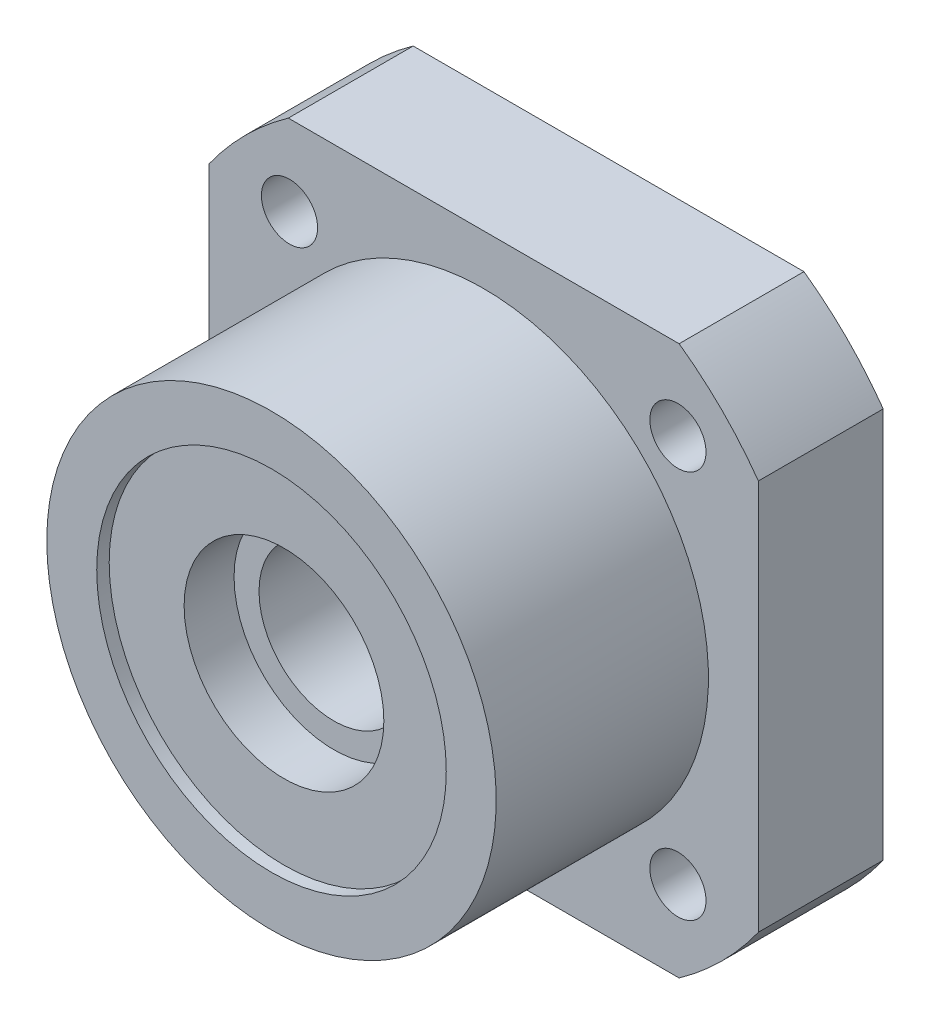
ISO-10303-21;
HEADER;
FILE_DESCRIPTION(('STEP AP214'),'2;1');
FILE_NAME('part.step','',(''),(''),'','','');
FILE_SCHEMA(('AUTOMOTIVE_DESIGN { 1 0 10303 214 1 1 1 1 }'));
ENDSEC;
DATA;
#1=APPLICATION_CONTEXT('core data for automotive mechanical design processes');
#2=APPLICATION_PROTOCOL_DEFINITION('international standard','automotive_design',2000,#1);
#3=PRODUCT_CONTEXT('',#1,'mechanical');
#4=PRODUCT('Part','Part','',(#3));
#5=PRODUCT_RELATED_PRODUCT_CATEGORY('part','',(#4));
#6=PRODUCT_DEFINITION_FORMATION('','',#4);
#7=PRODUCT_DEFINITION_CONTEXT('part definition',#1,'design');
#8=PRODUCT_DEFINITION('design','',#6,#7);
#9=PRODUCT_DEFINITION_SHAPE('','',#8);
#10=(LENGTH_UNIT() NAMED_UNIT(*) SI_UNIT(.MILLI.,.METRE.));
#11=(NAMED_UNIT(*) PLANE_ANGLE_UNIT() SI_UNIT($,.RADIAN.));
#12=(NAMED_UNIT(*) SI_UNIT($,.STERADIAN.) SOLID_ANGLE_UNIT());
#13=UNCERTAINTY_MEASURE_WITH_UNIT(LENGTH_MEASURE(1.E-05),#10,'distance_accuracy_value','');
#14=(GEOMETRIC_REPRESENTATION_CONTEXT(3) GLOBAL_UNCERTAINTY_ASSIGNED_CONTEXT((#13)) GLOBAL_UNIT_ASSIGNED_CONTEXT((#10,
#11,#12)) REPRESENTATION_CONTEXT('',''));
#15=CARTESIAN_POINT('',(0.,0.,0.));
#16=DIRECTION('',(0.,0.,1.));
#17=DIRECTION('',(1.,0.,0.));
#18=AXIS2_PLACEMENT_3D('',#15,#16,#17);
#19=CARTESIAN_POINT('',(-18.216,-18.216,27.));
#20=DIRECTION('',(0.,0.,1.));
#21=DIRECTION('',(1.,0.,0.));
#22=AXIS2_PLACEMENT_3D('',#19,#20,#21);
#23=PLANE('',#22);
#24=CARTESIAN_POINT('',(0.,0.,27.));
#25=DIRECTION('',(0.,0.,1.));
#26=DIRECTION('',(1.,0.,0.));
#27=AXIS2_PLACEMENT_3D('',#24,#25,#26);
#28=CIRCLE('',#27,14.);
#29=CARTESIAN_POINT('',(14.,0.,27.));
#30=VERTEX_POINT('',#29);
#31=EDGE_CURVE('E207',#30,#30,#28,.T.);
#32=ORIENTED_EDGE('',*,*,#31,.F.);
#33=EDGE_LOOP('',(#32));
#34=FACE_BOUND('',#33,.T.);
#35=CARTESIAN_POINT('',(0.,0.,27.));
#36=DIRECTION('',(0.,0.,-1.));
#37=DIRECTION('',(-1.,0.,0.));
#38=AXIS2_PLACEMENT_3D('',#35,#36,#37);
#39=CIRCLE('',#38,18.);
#40=CARTESIAN_POINT('',(-18.,0.,27.));
#41=VERTEX_POINT('',#40);
#42=EDGE_CURVE('E21',#41,#41,#39,.F.);
#43=ORIENTED_EDGE('',*,*,#42,.T.);
#44=EDGE_LOOP('',(#43));
#45=FACE_BOUND('',#44,.T.);
#46=ADVANCED_FACE('F17',(#34,#45),#23,.T.);
#47=CARTESIAN_POINT('',(0.,0.,27.));
#48=DIRECTION('',(0.,0.,-1.));
#49=DIRECTION('',(-1.,0.,0.));
#50=AXIS2_PLACEMENT_3D('',#47,#48,#49);
#51=CYLINDRICAL_SURFACE('',#50,18.);
#52=ORIENTED_EDGE('',*,*,#42,.F.);
#53=EDGE_LOOP('',(#52));
#54=FACE_BOUND('',#53,.T.);
#55=CARTESIAN_POINT('',(0.,0.,10.));
#56=DIRECTION('',(0.,0.,-1.));
#57=DIRECTION('',(-1.,0.,0.));
#58=AXIS2_PLACEMENT_3D('',#55,#56,#57);
#59=CIRCLE('',#58,18.);
#60=CARTESIAN_POINT('',(-18.,0.,10.));
#61=VERTEX_POINT('',#60);
#62=EDGE_CURVE('E205',#61,#61,#59,.T.);
#63=ORIENTED_EDGE('',*,*,#62,.F.);
#64=EDGE_LOOP('',(#63));
#65=FACE_BOUND('',#64,.T.);
#66=ADVANCED_FACE('F215',(#54,#65),#51,.T.);
#67=CARTESIAN_POINT('',(15.556349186,15.556349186,10.));
#68=DIRECTION('',(0.,0.,-1.));
#69=DIRECTION('',(-1.,0.,0.));
#70=AXIS2_PLACEMENT_3D('',#67,#68,#69);
#71=CYLINDRICAL_SURFACE('',#70,2.25);
#72=CARTESIAN_POINT('',(15.556349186,15.556349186,10.));
#73=DIRECTION('',(0.,0.,-1.));
#74=DIRECTION('',(-1.,0.,0.));
#75=AXIS2_PLACEMENT_3D('',#72,#73,#74);
#76=CIRCLE('',#75,2.25);
#77=CARTESIAN_POINT('',(13.306349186,15.556349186,10.));
#78=VERTEX_POINT('',#77);
#79=EDGE_CURVE('E193',#78,#78,#76,.T.);
#80=ORIENTED_EDGE('',*,*,#79,.F.);
#81=EDGE_LOOP('',(#80));
#82=FACE_BOUND('',#81,.T.);
#83=CARTESIAN_POINT('',(15.556349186,15.556349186,4.));
#84=DIRECTION('',(0.,0.,-1.));
#85=DIRECTION('',(-1.,0.,0.));
#86=AXIS2_PLACEMENT_3D('',#83,#84,#85);
#87=CIRCLE('',#86,2.25);
#88=CARTESIAN_POINT('',(13.306349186,15.556349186,4.));
#89=VERTEX_POINT('',#88);
#90=EDGE_CURVE('E190',#89,#89,#87,.F.);
#91=ORIENTED_EDGE('',*,*,#90,.F.);
#92=EDGE_LOOP('',(#91));
#93=FACE_BOUND('',#92,.T.);
#94=ADVANCED_FACE('F218',(#82,#93),#71,.F.);
#95=CARTESIAN_POINT('',(-15.556349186,15.556349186,10.));
#96=DIRECTION('',(0.,0.,-1.));
#97=DIRECTION('',(-1.,0.,0.));
#98=AXIS2_PLACEMENT_3D('',#95,#96,#97);
#99=CYLINDRICAL_SURFACE('',#98,2.25);
#100=CARTESIAN_POINT('',(-15.556349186,15.556349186,10.));
#101=DIRECTION('',(0.,0.,-1.));
#102=DIRECTION('',(-1.,0.,0.));
#103=AXIS2_PLACEMENT_3D('',#100,#101,#102);
#104=CIRCLE('',#103,2.25);
#105=CARTESIAN_POINT('',(-17.806349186,15.556349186,10.));
#106=VERTEX_POINT('',#105);
#107=EDGE_CURVE('E202',#106,#106,#104,.T.);
#108=ORIENTED_EDGE('',*,*,#107,.F.);
#109=EDGE_LOOP('',(#108));
#110=FACE_BOUND('',#109,.T.);
#111=CARTESIAN_POINT('',(-15.556349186,15.556349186,4.));
#112=DIRECTION('',(0.,0.,-1.));
#113=DIRECTION('',(-1.,0.,0.));
#114=AXIS2_PLACEMENT_3D('',#111,#112,#113);
#115=CIRCLE('',#114,2.25);
#116=CARTESIAN_POINT('',(-17.806349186,15.556349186,4.));
#117=VERTEX_POINT('',#116);
#118=EDGE_CURVE('E187',#117,#117,#115,.F.);
#119=ORIENTED_EDGE('',*,*,#118,.F.);
#120=EDGE_LOOP('',(#119));
#121=FACE_BOUND('',#120,.T.);
#122=ADVANCED_FACE('F304',(#110,#121),#99,.F.);
#123=CARTESIAN_POINT('',(-15.556349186,-15.556349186,10.));
#124=DIRECTION('',(0.,0.,-1.));
#125=DIRECTION('',(-1.,0.,0.));
#126=AXIS2_PLACEMENT_3D('',#123,#124,#125);
#127=CYLINDRICAL_SURFACE('',#126,2.25);
#128=CARTESIAN_POINT('',(-15.556349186,-15.556349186,10.));
#129=DIRECTION('',(0.,0.,-1.));
#130=DIRECTION('',(-1.,0.,0.));
#131=AXIS2_PLACEMENT_3D('',#128,#129,#130);
#132=CIRCLE('',#131,2.25);
#133=CARTESIAN_POINT('',(-17.806349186,-15.556349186,10.));
#134=VERTEX_POINT('',#133);
#135=EDGE_CURVE('E199',#134,#134,#132,.T.);
#136=ORIENTED_EDGE('',*,*,#135,.F.);
#137=EDGE_LOOP('',(#136));
#138=FACE_BOUND('',#137,.T.);
#139=CARTESIAN_POINT('',(-15.556349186,-15.556349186,4.));
#140=DIRECTION('',(0.,0.,-1.));
#141=DIRECTION('',(-1.,0.,0.));
#142=AXIS2_PLACEMENT_3D('',#139,#140,#141);
#143=CIRCLE('',#142,2.25);
#144=CARTESIAN_POINT('',(-17.806349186,-15.556349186,4.));
#145=VERTEX_POINT('',#144);
#146=EDGE_CURVE('E184',#145,#145,#143,.F.);
#147=ORIENTED_EDGE('',*,*,#146,.F.);
#148=EDGE_LOOP('',(#147));
#149=FACE_BOUND('',#148,.T.);
#150=ADVANCED_FACE('F300',(#138,#149),#127,.F.);
#151=CARTESIAN_POINT('',(15.556349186,-15.556349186,10.));
#152=DIRECTION('',(0.,0.,-1.));
#153=DIRECTION('',(-1.,0.,0.));
#154=AXIS2_PLACEMENT_3D('',#151,#152,#153);
#155=CYLINDRICAL_SURFACE('',#154,2.25);
#156=CARTESIAN_POINT('',(15.556349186,-15.556349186,10.));
#157=DIRECTION('',(0.,0.,-1.));
#158=DIRECTION('',(-1.,0.,0.));
#159=AXIS2_PLACEMENT_3D('',#156,#157,#158);
#160=CIRCLE('',#159,2.25);
#161=CARTESIAN_POINT('',(13.306349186,-15.556349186,10.));
#162=VERTEX_POINT('',#161);
#163=EDGE_CURVE('E196',#162,#162,#160,.T.);
#164=ORIENTED_EDGE('',*,*,#163,.F.);
#165=EDGE_LOOP('',(#164));
#166=FACE_BOUND('',#165,.T.);
#167=CARTESIAN_POINT('',(15.556349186,-15.556349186,4.));
#168=DIRECTION('',(0.,0.,-1.));
#169=DIRECTION('',(-1.,0.,0.));
#170=AXIS2_PLACEMENT_3D('',#167,#168,#169);
#171=CIRCLE('',#170,2.25);
#172=CARTESIAN_POINT('',(13.306349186,-15.556349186,4.));
#173=VERTEX_POINT('',#172);
#174=EDGE_CURVE('E181',#173,#173,#171,.F.);
#175=ORIENTED_EDGE('',*,*,#174,.F.);
#176=EDGE_LOOP('',(#175));
#177=FACE_BOUND('',#176,.T.);
#178=ADVANCED_FACE('F235',(#166,#177),#155,.F.);
#179=CARTESIAN_POINT('',(0.,0.,26.));
#180=DIRECTION('',(0.,0.,1.));
#181=DIRECTION('',(1.,0.,0.));
#182=AXIS2_PLACEMENT_3D('',#179,#180,#181);
#183=CYLINDRICAL_SURFACE('',#182,14.);
#184=ORIENTED_EDGE('',*,*,#31,.T.);
#185=EDGE_LOOP('',(#184));
#186=FACE_BOUND('',#185,.T.);
#187=CARTESIAN_POINT('',(0.,0.,26.));
#188=DIRECTION('',(0.,0.,1.));
#189=DIRECTION('',(1.,0.,0.));
#190=AXIS2_PLACEMENT_3D('',#187,#188,#189);
#191=CIRCLE('',#190,14.);
#192=CARTESIAN_POINT('',(14.,0.,26.));
#193=VERTEX_POINT('',#192);
#194=EDGE_CURVE('E91',#193,#193,#191,.T.);
#195=ORIENTED_EDGE('',*,*,#194,.F.);
#196=EDGE_LOOP('',(#195));
#197=FACE_BOUND('',#196,.T.);
#198=ADVANCED_FACE('F224',(#186,#197),#183,.F.);
#199=CARTESIAN_POINT('',(-21.999999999,-22.,10.));
#200=DIRECTION('',(0.,0.,1.));
#201=DIRECTION('',(1.,0.,0.));
#202=AXIS2_PLACEMENT_3D('',#199,#200,#201);
#203=PLANE('',#202);
#204=ORIENTED_EDGE('',*,*,#79,.T.);
#205=EDGE_LOOP('',(#204));
#206=FACE_BOUND('',#205,.T.);
#207=ORIENTED_EDGE('',*,*,#163,.T.);
#208=EDGE_LOOP('',(#207));
#209=FACE_BOUND('',#208,.T.);
#210=ORIENTED_EDGE('',*,*,#135,.T.);
#211=EDGE_LOOP('',(#210));
#212=FACE_BOUND('',#211,.T.);
#213=ORIENTED_EDGE('',*,*,#107,.T.);
#214=EDGE_LOOP('',(#213));
#215=FACE_BOUND('',#214,.T.);
#216=ORIENTED_EDGE('',*,*,#62,.T.);
#217=EDGE_LOOP('',(#216));
#218=FACE_BOUND('',#217,.T.);
#219=CARTESIAN_POINT('',(0.,0.,10.));
#220=DIRECTION('',(0.,0.,-1.));
#221=DIRECTION('',(-1.,0.,0.));
#222=AXIS2_PLACEMENT_3D('',#219,#220,#221);
#223=CIRCLE('',#222,27.);
#224=CARTESIAN_POINT('',(15.6524758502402,-21.999999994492,10.));
#225=VERTEX_POINT('',#224);
#226=CARTESIAN_POINT('',(22.,-15.6524758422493,10.));
#227=VERTEX_POINT('',#226);
#228=EDGE_CURVE('E175',#225,#227,#223,.F.);
#229=ORIENTED_EDGE('',*,*,#228,.T.);
#230=DIRECTION('',(0.,1.,0.));
#231=VECTOR('',#230,1.);
#232=CARTESIAN_POINT('',(22.,-1.49999804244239E-09,10.));
#233=LINE('',#232,#231);
#234=CARTESIAN_POINT('',(22.000000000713,15.6524758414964,10.));
#235=VERTEX_POINT('',#234);
#236=EDGE_CURVE('E106',#227,#235,#233,.T.);
#237=ORIENTED_EDGE('',*,*,#236,.T.);
#238=CARTESIAN_POINT('',(0.,0.,10.));
#239=DIRECTION('',(0.,0.,-1.));
#240=DIRECTION('',(-1.,0.,0.));
#241=AXIS2_PLACEMENT_3D('',#238,#239,#240);
#242=CIRCLE('',#241,27.);
#243=CARTESIAN_POINT('',(15.6524758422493,22.,10.));
#244=VERTEX_POINT('',#243);
#245=EDGE_CURVE('E100',#235,#244,#242,.F.);
#246=ORIENTED_EDGE('',*,*,#245,.T.);
#247=DIRECTION('',(-1.,0.,0.));
#248=VECTOR('',#247,1.);
#249=CARTESIAN_POINT('',(4.99999347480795E-10,22.,10.));
#250=LINE('',#249,#248);
#251=CARTESIAN_POINT('',(-15.6524758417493,22.,10.));
#252=VERTEX_POINT('',#251);
#253=EDGE_CURVE('E94',#244,#252,#250,.T.);
#254=ORIENTED_EDGE('',*,*,#253,.T.);
#255=CARTESIAN_POINT('',(0.,0.,10.));
#256=DIRECTION('',(0.,0.,-1.));
#257=DIRECTION('',(-1.,0.,0.));
#258=AXIS2_PLACEMENT_3D('',#255,#256,#257);
#259=CIRCLE('',#258,27.);
#260=CARTESIAN_POINT('',(-22.,15.6524758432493,10.));
#261=VERTEX_POINT('',#260);
#262=EDGE_CURVE('E82',#252,#261,#259,.F.);
#263=ORIENTED_EDGE('',*,*,#262,.T.);
#264=DIRECTION('',(0.,-1.,0.));
#265=VECTOR('',#264,1.);
#266=CARTESIAN_POINT('',(-22.,-1.00000042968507E-09,10.));
#267=LINE('',#266,#265);
#268=CARTESIAN_POINT('',(-21.9999999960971,-15.6524758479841,10.));
#269=VERTEX_POINT('',#268);
#270=EDGE_CURVE('E114',#261,#269,#267,.T.);
#271=ORIENTED_EDGE('',*,*,#270,.T.);
#272=CARTESIAN_POINT('',(0.,0.,10.));
#273=DIRECTION('',(0.,0.,-1.));
#274=DIRECTION('',(-1.,0.,0.));
#275=AXIS2_PLACEMENT_3D('',#272,#273,#274);
#276=CIRCLE('',#275,27.);
#277=CARTESIAN_POINT('',(-15.6524758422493,-22.,10.));
#278=VERTEX_POINT('',#277);
#279=EDGE_CURVE('E177',#269,#278,#276,.F.);
#280=ORIENTED_EDGE('',*,*,#279,.T.);
#281=DIRECTION('',(1.,0.,0.));
#282=VECTOR('',#281,1.);
#283=CARTESIAN_POINT('',(3.0000012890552E-09,-22.,10.));
#284=LINE('',#283,#282);
#285=EDGE_CURVE('E110',#278,#225,#284,.T.);
#286=ORIENTED_EDGE('',*,*,#285,.T.);
#287=EDGE_LOOP('',(#229,#237,#246,#254,#263,#271,#280,#286));
#288=FACE_BOUND('',#287,.T.);
#289=ADVANCED_FACE('F98',(#206,#209,#212,#215,#218,#288),#203,.T.);
#290=CARTESIAN_POINT('',(19.604349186,11.508349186,4.));
#291=DIRECTION('',(0.,0.,-1.));
#292=DIRECTION('',(-1.,0.,0.));
#293=AXIS2_PLACEMENT_3D('',#290,#291,#292);
#294=PLANE('',#293);
#295=ORIENTED_EDGE('',*,*,#90,.T.);
#296=EDGE_LOOP('',(#295));
#297=FACE_BOUND('',#296,.T.);
#298=CARTESIAN_POINT('',(15.556349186,15.556349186,4.));
#299=DIRECTION('',(0.,0.,-1.));
#300=DIRECTION('',(-1.,0.,0.));
#301=AXIS2_PLACEMENT_3D('',#298,#299,#300);
#302=CIRCLE('',#301,4.);
#303=CARTESIAN_POINT('',(11.556349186,15.556349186,4.));
#304=VERTEX_POINT('',#303);
#305=EDGE_CURVE('E96',#304,#304,#302,.F.);
#306=ORIENTED_EDGE('',*,*,#305,.F.);
#307=EDGE_LOOP('',(#306));
#308=FACE_BOUND('',#307,.T.);
#309=ADVANCED_FACE('F223',(#297,#308),#294,.T.);
#310=CARTESIAN_POINT('',(-11.508349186,11.508349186,4.));
#311=DIRECTION('',(0.,0.,-1.));
#312=DIRECTION('',(-1.,0.,0.));
#313=AXIS2_PLACEMENT_3D('',#310,#311,#312);
#314=PLANE('',#313);
#315=ORIENTED_EDGE('',*,*,#118,.T.);
#316=EDGE_LOOP('',(#315));
#317=FACE_BOUND('',#316,.T.);
#318=CARTESIAN_POINT('',(-15.556349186,15.556349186,4.));
#319=DIRECTION('',(0.,0.,-1.));
#320=DIRECTION('',(-1.,0.,0.));
#321=AXIS2_PLACEMENT_3D('',#318,#319,#320);
#322=CIRCLE('',#321,4.);
#323=CARTESIAN_POINT('',(-19.556349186,15.556349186,4.));
#324=VERTEX_POINT('',#323);
#325=EDGE_CURVE('E169',#324,#324,#322,.F.);
#326=ORIENTED_EDGE('',*,*,#325,.F.);
#327=EDGE_LOOP('',(#326));
#328=FACE_BOUND('',#327,.T.);
#329=ADVANCED_FACE('F232',(#317,#328),#314,.T.);
#330=CARTESIAN_POINT('',(-11.508349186,-19.604349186,4.));
#331=DIRECTION('',(0.,0.,-1.));
#332=DIRECTION('',(-1.,0.,0.));
#333=AXIS2_PLACEMENT_3D('',#330,#331,#332);
#334=PLANE('',#333);
#335=ORIENTED_EDGE('',*,*,#146,.T.);
#336=EDGE_LOOP('',(#335));
#337=FACE_BOUND('',#336,.T.);
#338=CARTESIAN_POINT('',(-15.556349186,-15.556349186,4.));
#339=DIRECTION('',(0.,0.,-1.));
#340=DIRECTION('',(-1.,0.,0.));
#341=AXIS2_PLACEMENT_3D('',#338,#339,#340);
#342=CIRCLE('',#341,4.);
#343=CARTESIAN_POINT('',(-19.556349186,-15.556349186,4.));
#344=VERTEX_POINT('',#343);
#345=EDGE_CURVE('E166',#344,#344,#342,.F.);
#346=ORIENTED_EDGE('',*,*,#345,.F.);
#347=EDGE_LOOP('',(#346));
#348=FACE_BOUND('',#347,.T.);
#349=ADVANCED_FACE('F363',(#337,#348),#334,.T.);
#350=CARTESIAN_POINT('',(19.604349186,-19.604349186,4.));
#351=DIRECTION('',(0.,0.,-1.));
#352=DIRECTION('',(-1.,0.,0.));
#353=AXIS2_PLACEMENT_3D('',#350,#351,#352);
#354=PLANE('',#353);
#355=ORIENTED_EDGE('',*,*,#174,.T.);
#356=EDGE_LOOP('',(#355));
#357=FACE_BOUND('',#356,.T.);
#358=CARTESIAN_POINT('',(15.556349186,-15.556349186,4.));
#359=DIRECTION('',(0.,0.,-1.));
#360=DIRECTION('',(-1.,0.,0.));
#361=AXIS2_PLACEMENT_3D('',#358,#359,#360);
#362=CIRCLE('',#361,4.);
#363=CARTESIAN_POINT('',(11.556349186,-15.556349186,4.));
#364=VERTEX_POINT('',#363);
#365=EDGE_CURVE('E163',#364,#364,#362,.F.);
#366=ORIENTED_EDGE('',*,*,#365,.F.);
#367=EDGE_LOOP('',(#366));
#368=FACE_BOUND('',#367,.T.);
#369=ADVANCED_FACE('F373',(#357,#368),#354,.T.);
#370=CARTESIAN_POINT('',(-14.168,-14.168,26.));
#371=DIRECTION('',(0.,0.,1.));
#372=DIRECTION('',(1.,0.,0.));
#373=AXIS2_PLACEMENT_3D('',#370,#371,#372);
#374=PLANE('',#373);
#375=CARTESIAN_POINT('',(0.,0.,26.));
#376=DIRECTION('',(0.,0.,-1.));
#377=DIRECTION('',(-1.,0.,0.));
#378=AXIS2_PLACEMENT_3D('',#375,#376,#377);
#379=CIRCLE('',#378,8.);
#380=CARTESIAN_POINT('',(-8.,0.,26.));
#381=VERTEX_POINT('',#380);
#382=EDGE_CURVE('E160',#381,#381,#379,.F.);
#383=ORIENTED_EDGE('',*,*,#382,.F.);
#384=EDGE_LOOP('',(#383));
#385=FACE_BOUND('',#384,.T.);
#386=ORIENTED_EDGE('',*,*,#194,.T.);
#387=EDGE_LOOP('',(#386));
#388=FACE_BOUND('',#387,.T.);
#389=ADVANCED_FACE('F296',(#385,#388),#374,.T.);
#390=CARTESIAN_POINT('',(0.,0.,10.));
#391=DIRECTION('',(0.,0.,-1.));
#392=DIRECTION('',(-1.,0.,0.));
#393=AXIS2_PLACEMENT_3D('',#390,#391,#392);
#394=CYLINDRICAL_SURFACE('',#393,27.);
#395=ORIENTED_EDGE('',*,*,#262,.F.);
#396=DIRECTION('',(0.,0.,-1.));
#397=VECTOR('',#396,1.);
#398=CARTESIAN_POINT('',(-15.652475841,22.,5.));
#399=LINE('',#398,#397);
#400=CARTESIAN_POINT('',(-15.6524758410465,22.0000000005,0.));
#401=VERTEX_POINT('',#400);
#402=EDGE_CURVE('E86',#252,#401,#399,.T.);
#403=ORIENTED_EDGE('',*,*,#402,.T.);
#404=CARTESIAN_POINT('',(0.,0.,0.));
#405=DIRECTION('',(0.,0.,-1.));
#406=DIRECTION('',(-1.,0.,0.));
#407=AXIS2_PLACEMENT_3D('',#404,#405,#406);
#408=CIRCLE('',#407,27.);
#409=CARTESIAN_POINT('',(-21.9999999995,15.652475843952,0.));
#410=VERTEX_POINT('',#409);
#411=EDGE_CURVE('E158',#401,#410,#408,.F.);
#412=ORIENTED_EDGE('',*,*,#411,.T.);
#413=DIRECTION('',(0.,0.,1.));
#414=VECTOR('',#413,1.);
#415=CARTESIAN_POINT('',(-22.,15.652475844,5.));
#416=LINE('',#415,#414);
#417=EDGE_CURVE('E87',#410,#261,#416,.T.);
#418=ORIENTED_EDGE('',*,*,#417,.T.);
#419=EDGE_LOOP('',(#395,#403,#412,#418));
#420=FACE_BOUND('',#419,.T.);
#421=ADVANCED_FACE('F84',(#420),#394,.T.);
#422=CARTESIAN_POINT('',(-22.,-15.652475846,10.));
#423=DIRECTION('',(1.,0.,0.));
#424=DIRECTION('',(0.,0.,-1.));
#425=AXIS2_PLACEMENT_3D('',#422,#423,#424);
#426=PLANE('',#425);
#427=ORIENTED_EDGE('',*,*,#270,.F.);
#428=ORIENTED_EDGE('',*,*,#417,.F.);
#429=DIRECTION('',(0.,-1.,0.));
#430=VECTOR('',#429,1.);
#431=CARTESIAN_POINT('',(-21.999999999,5.00001082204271E-10,0.));
#432=LINE('',#431,#430);
#433=CARTESIAN_POINT('',(-21.9999999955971,-15.6524758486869,0.));
#434=VERTEX_POINT('',#433);
#435=EDGE_CURVE('E157',#410,#434,#432,.T.);
#436=ORIENTED_EDGE('',*,*,#435,.T.);
#437=DIRECTION('',(0.,0.,-1.));
#438=VECTOR('',#437,1.);
#439=CARTESIAN_POINT('',(-21.9999999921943,-15.6524758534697,5.));
#440=LINE('',#439,#438);
#441=EDGE_CURVE('E115',#434,#269,#440,.F.);
#442=ORIENTED_EDGE('',*,*,#441,.T.);
#443=EDGE_LOOP('',(#427,#428,#436,#442));
#444=FACE_BOUND('',#443,.T.);
#445=ADVANCED_FACE('F293',(#444),#426,.F.);
#446=CARTESIAN_POINT('',(0.,0.,10.));
#447=DIRECTION('',(0.,0.,-1.));
#448=DIRECTION('',(-1.,0.,0.));
#449=AXIS2_PLACEMENT_3D('',#446,#447,#448);
#450=CYLINDRICAL_SURFACE('',#449,27.);
#451=ORIENTED_EDGE('',*,*,#279,.F.);
#452=ORIENTED_EDGE('',*,*,#441,.F.);
#453=CARTESIAN_POINT('',(0.,0.,0.));
#454=DIRECTION('',(0.,0.,-1.));
#455=DIRECTION('',(-1.,0.,0.));
#456=AXIS2_PLACEMENT_3D('',#453,#454,#455);
#457=CIRCLE('',#456,27.);
#458=CARTESIAN_POINT('',(-15.6524758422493,-22.,0.));
#459=VERTEX_POINT('',#458);
#460=EDGE_CURVE('E154',#434,#459,#457,.F.);
#461=ORIENTED_EDGE('',*,*,#460,.T.);
#462=DIRECTION('',(0.,0.,1.));
#463=VECTOR('',#462,1.);
#464=CARTESIAN_POINT('',(-15.652475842,-22.,5.));
#465=LINE('',#464,#463);
#466=EDGE_CURVE('E113',#459,#278,#465,.T.);
#467=ORIENTED_EDGE('',*,*,#466,.T.);
#468=EDGE_LOOP('',(#451,#452,#461,#467));
#469=FACE_BOUND('',#468,.T.);
#470=ADVANCED_FACE('F290',(#469),#450,.T.);
#471=CARTESIAN_POINT('',(15.652475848,-22.,0.));
#472=DIRECTION('',(0.,1.,0.));
#473=DIRECTION('',(-1.,0.,0.));
#474=AXIS2_PLACEMENT_3D('',#471,#472,#473);
#475=PLANE('',#474);
#476=ORIENTED_EDGE('',*,*,#285,.F.);
#477=ORIENTED_EDGE('',*,*,#466,.F.);
#478=DIRECTION('',(1.,0.,0.));
#479=VECTOR('',#478,1.);
#480=CARTESIAN_POINT('',(1.49999977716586E-09,-22.,0.));
#481=LINE('',#480,#479);
#482=CARTESIAN_POINT('',(15.6524758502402,-21.999999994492,0.));
#483=VERTEX_POINT('',#482);
#484=EDGE_CURVE('E153',#459,#483,#481,.T.);
#485=ORIENTED_EDGE('',*,*,#484,.T.);
#486=DIRECTION('',(0.,0.,-1.));
#487=VECTOR('',#486,1.);
#488=CARTESIAN_POINT('',(15.6524758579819,-21.9999999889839,5.));
#489=LINE('',#488,#487);
#490=EDGE_CURVE('E112',#483,#225,#489,.F.);
#491=ORIENTED_EDGE('',*,*,#490,.T.);
#492=EDGE_LOOP('',(#476,#477,#485,#491));
#493=FACE_BOUND('',#492,.T.);
#494=ADVANCED_FACE('F288',(#493),#475,.F.);
#495=CARTESIAN_POINT('',(0.,0.,10.));
#496=DIRECTION('',(0.,0.,-1.));
#497=DIRECTION('',(-1.,0.,0.));
#498=AXIS2_PLACEMENT_3D('',#495,#496,#497);
#499=CYLINDRICAL_SURFACE('',#498,27.);
#500=ORIENTED_EDGE('',*,*,#228,.F.);
#501=ORIENTED_EDGE('',*,*,#490,.F.);
#502=CARTESIAN_POINT('',(0.,0.,0.));
#503=DIRECTION('',(0.,0.,-1.));
#504=DIRECTION('',(-1.,0.,0.));
#505=AXIS2_PLACEMENT_3D('',#502,#503,#504);
#506=CIRCLE('',#505,27.);
#507=CARTESIAN_POINT('',(22.000000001,-15.6524758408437,0.));
#508=VERTEX_POINT('',#507);
#509=EDGE_CURVE('E150',#483,#508,#506,.F.);
#510=ORIENTED_EDGE('',*,*,#509,.T.);
#511=DIRECTION('',(0.,0.,1.));
#512=VECTOR('',#511,1.);
#513=CARTESIAN_POINT('',(22.,-15.652475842,5.));
#514=LINE('',#513,#512);
#515=EDGE_CURVE('E109',#508,#227,#514,.T.);
#516=ORIENTED_EDGE('',*,*,#515,.T.);
#517=EDGE_LOOP('',(#500,#501,#510,#516));
#518=FACE_BOUND('',#517,.T.);
#519=ADVANCED_FACE('F285',(#518),#499,.T.);
#520=CARTESIAN_POINT('',(22.,15.652475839,0.));
#521=DIRECTION('',(-1.,0.,0.));
#522=DIRECTION('',(0.,-1.,0.));
#523=AXIS2_PLACEMENT_3D('',#520,#521,#522);
#524=PLANE('',#523);
#525=ORIENTED_EDGE('',*,*,#236,.F.);
#526=ORIENTED_EDGE('',*,*,#515,.F.);
#527=DIRECTION('',(0.,1.,0.));
#528=VECTOR('',#527,1.);
#529=CARTESIAN_POINT('',(22.000000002,5.00001082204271E-10,0.));
#530=LINE('',#529,#528);
#531=CARTESIAN_POINT('',(22.000000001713,15.6524758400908,0.));
#532=VERTEX_POINT('',#531);
#533=EDGE_CURVE('E149',#508,#532,#530,.T.);
#534=ORIENTED_EDGE('',*,*,#533,.T.);
#535=DIRECTION('',(0.,0.,-1.));
#536=VECTOR('',#535,1.);
#537=CARTESIAN_POINT('',(22.000000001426,15.6524758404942,5.));
#538=LINE('',#537,#536);
#539=EDGE_CURVE('E108',#532,#235,#538,.F.);
#540=ORIENTED_EDGE('',*,*,#539,.T.);
#541=EDGE_LOOP('',(#525,#526,#534,#540));
#542=FACE_BOUND('',#541,.T.);
#543=ADVANCED_FACE('F283',(#542),#524,.F.);
#544=CARTESIAN_POINT('',(0.,0.,10.));
#545=DIRECTION('',(0.,0.,-1.));
#546=DIRECTION('',(-1.,0.,0.));
#547=AXIS2_PLACEMENT_3D('',#544,#545,#546);
#548=CYLINDRICAL_SURFACE('',#547,27.);
#549=ORIENTED_EDGE('',*,*,#245,.F.);
#550=ORIENTED_EDGE('',*,*,#539,.F.);
#551=CARTESIAN_POINT('',(0.,0.,0.));
#552=DIRECTION('',(0.,0.,-1.));
#553=DIRECTION('',(-1.,0.,0.));
#554=AXIS2_PLACEMENT_3D('',#551,#552,#553);
#555=CIRCLE('',#554,27.);
#556=CARTESIAN_POINT('',(15.6524758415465,22.0000000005,0.));
#557=VERTEX_POINT('',#556);
#558=EDGE_CURVE('E146',#532,#557,#555,.F.);
#559=ORIENTED_EDGE('',*,*,#558,.T.);
#560=DIRECTION('',(0.,0.,1.));
#561=VECTOR('',#560,1.);
#562=CARTESIAN_POINT('',(15.652475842,22.,5.));
#563=LINE('',#562,#561);
#564=EDGE_CURVE('E36',#557,#244,#563,.T.);
#565=ORIENTED_EDGE('',*,*,#564,.T.);
#566=EDGE_LOOP('',(#549,#550,#559,#565));
#567=FACE_BOUND('',#566,.T.);
#568=ADVANCED_FACE('F280',(#567),#548,.T.);
#569=CARTESIAN_POINT('',(-15.652475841,22.,0.));
#570=DIRECTION('',(0.,-1.,0.));
#571=DIRECTION('',(1.,0.,0.));
#572=AXIS2_PLACEMENT_3D('',#569,#570,#571);
#573=PLANE('',#572);
#574=ORIENTED_EDGE('',*,*,#253,.F.);
#575=ORIENTED_EDGE('',*,*,#564,.F.);
#576=DIRECTION('',(-1.,0.,0.));
#577=VECTOR('',#576,1.);
#578=CARTESIAN_POINT('',(1.49999977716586E-09,22.000000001,0.));
#579=LINE('',#578,#577);
#580=EDGE_CURVE('E95',#557,#401,#579,.T.);
#581=ORIENTED_EDGE('',*,*,#580,.T.);
#582=ORIENTED_EDGE('',*,*,#402,.F.);
#583=EDGE_LOOP('',(#574,#575,#581,#582));
#584=FACE_BOUND('',#583,.T.);
#585=ADVANCED_FACE('F93',(#584),#573,.F.);
#586=CARTESIAN_POINT('',(15.556349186,15.556349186,4.));
#587=DIRECTION('',(0.,0.,-1.));
#588=DIRECTION('',(-1.,0.,0.));
#589=AXIS2_PLACEMENT_3D('',#586,#587,#588);
#590=CYLINDRICAL_SURFACE('',#589,4.);
#591=ORIENTED_EDGE('',*,*,#305,.T.);
#592=EDGE_LOOP('',(#591));
#593=FACE_BOUND('',#592,.T.);
#594=CARTESIAN_POINT('',(15.556349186,15.556349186,0.));
#595=DIRECTION('',(0.,0.,-1.));
#596=DIRECTION('',(-1.,0.,0.));
#597=AXIS2_PLACEMENT_3D('',#594,#595,#596);
#598=CIRCLE('',#597,4.);
#599=CARTESIAN_POINT('',(11.556349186,15.556349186,0.));
#600=VERTEX_POINT('',#599);
#601=EDGE_CURVE('E143',#600,#600,#598,.T.);
#602=ORIENTED_EDGE('',*,*,#601,.T.);
#603=EDGE_LOOP('',(#602));
#604=FACE_BOUND('',#603,.T.);
#605=ADVANCED_FACE('F275',(#593,#604),#590,.F.);
#606=CARTESIAN_POINT('',(-15.556349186,15.556349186,4.));
#607=DIRECTION('',(0.,0.,-1.));
#608=DIRECTION('',(-1.,0.,0.));
#609=AXIS2_PLACEMENT_3D('',#606,#607,#608);
#610=CYLINDRICAL_SURFACE('',#609,4.);
#611=ORIENTED_EDGE('',*,*,#325,.T.);
#612=EDGE_LOOP('',(#611));
#613=FACE_BOUND('',#612,.T.);
#614=CARTESIAN_POINT('',(-15.556349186,15.556349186,0.));
#615=DIRECTION('',(0.,0.,-1.));
#616=DIRECTION('',(-1.,0.,0.));
#617=AXIS2_PLACEMENT_3D('',#614,#615,#616);
#618=CIRCLE('',#617,4.);
#619=CARTESIAN_POINT('',(-19.556349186,15.556349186,0.));
#620=VERTEX_POINT('',#619);
#621=EDGE_CURVE('E140',#620,#620,#618,.T.);
#622=ORIENTED_EDGE('',*,*,#621,.T.);
#623=EDGE_LOOP('',(#622));
#624=FACE_BOUND('',#623,.T.);
#625=ADVANCED_FACE('F271',(#613,#624),#610,.F.);
#626=CARTESIAN_POINT('',(-15.556349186,-15.556349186,4.));
#627=DIRECTION('',(0.,0.,-1.));
#628=DIRECTION('',(-1.,0.,0.));
#629=AXIS2_PLACEMENT_3D('',#626,#627,#628);
#630=CYLINDRICAL_SURFACE('',#629,4.);
#631=ORIENTED_EDGE('',*,*,#345,.T.);
#632=EDGE_LOOP('',(#631));
#633=FACE_BOUND('',#632,.T.);
#634=CARTESIAN_POINT('',(-15.556349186,-15.556349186,0.));
#635=DIRECTION('',(0.,0.,-1.));
#636=DIRECTION('',(-1.,0.,0.));
#637=AXIS2_PLACEMENT_3D('',#634,#635,#636);
#638=CIRCLE('',#637,4.);
#639=CARTESIAN_POINT('',(-19.556349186,-15.556349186,0.));
#640=VERTEX_POINT('',#639);
#641=EDGE_CURVE('E137',#640,#640,#638,.T.);
#642=ORIENTED_EDGE('',*,*,#641,.T.);
#643=EDGE_LOOP('',(#642));
#644=FACE_BOUND('',#643,.T.);
#645=ADVANCED_FACE('F267',(#633,#644),#630,.F.);
#646=CARTESIAN_POINT('',(15.556349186,-15.556349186,4.));
#647=DIRECTION('',(0.,0.,-1.));
#648=DIRECTION('',(-1.,0.,0.));
#649=AXIS2_PLACEMENT_3D('',#646,#647,#648);
#650=CYLINDRICAL_SURFACE('',#649,4.);
#651=ORIENTED_EDGE('',*,*,#365,.T.);
#652=EDGE_LOOP('',(#651));
#653=FACE_BOUND('',#652,.T.);
#654=CARTESIAN_POINT('',(15.556349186,-15.556349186,0.));
#655=DIRECTION('',(0.,0.,-1.));
#656=DIRECTION('',(-1.,0.,0.));
#657=AXIS2_PLACEMENT_3D('',#654,#655,#656);
#658=CIRCLE('',#657,4.);
#659=CARTESIAN_POINT('',(11.556349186,-15.556349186,0.));
#660=VERTEX_POINT('',#659);
#661=EDGE_CURVE('E134',#660,#660,#658,.T.);
#662=ORIENTED_EDGE('',*,*,#661,.T.);
#663=EDGE_LOOP('',(#662));
#664=FACE_BOUND('',#663,.T.);
#665=ADVANCED_FACE('F263',(#653,#664),#650,.F.);
#666=CARTESIAN_POINT('',(0.,0.,26.));
#667=DIRECTION('',(0.,0.,-1.));
#668=DIRECTION('',(-1.,0.,0.));
#669=AXIS2_PLACEMENT_3D('',#666,#667,#668);
#670=CYLINDRICAL_SURFACE('',#669,8.);
#671=ORIENTED_EDGE('',*,*,#382,.T.);
#672=EDGE_LOOP('',(#671));
#673=FACE_BOUND('',#672,.T.);
#674=CARTESIAN_POINT('',(0.,0.,22.));
#675=DIRECTION('',(0.,0.,-1.));
#676=DIRECTION('',(-1.,0.,0.));
#677=AXIS2_PLACEMENT_3D('',#674,#675,#676);
#678=CIRCLE('',#677,8.);
#679=CARTESIAN_POINT('',(-8.,0.,22.));
#680=VERTEX_POINT('',#679);
#681=EDGE_CURVE('E131',#680,#680,#678,.F.);
#682=ORIENTED_EDGE('',*,*,#681,.F.);
#683=EDGE_LOOP('',(#682));
#684=FACE_BOUND('',#683,.T.);
#685=ADVANCED_FACE('F259',(#673,#684),#670,.F.);
#686=CARTESIAN_POINT('',(-21.999999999,-22.,0.));
#687=DIRECTION('',(0.,0.,1.));
#688=DIRECTION('',(1.,0.,0.));
#689=AXIS2_PLACEMENT_3D('',#686,#687,#688);
#690=PLANE('',#689);
#691=CARTESIAN_POINT('',(0.,0.,0.));
#692=DIRECTION('',(0.,0.,-1.));
#693=DIRECTION('',(-1.,0.,0.));
#694=AXIS2_PLACEMENT_3D('',#691,#692,#693);
#695=CIRCLE('',#694,14.);
#696=CARTESIAN_POINT('',(-14.,0.,0.));
#697=VERTEX_POINT('',#696);
#698=EDGE_CURVE('E128',#697,#697,#695,.T.);
#699=ORIENTED_EDGE('',*,*,#698,.F.);
#700=EDGE_LOOP('',(#699));
#701=FACE_BOUND('',#700,.T.);
#702=ORIENTED_EDGE('',*,*,#661,.F.);
#703=EDGE_LOOP('',(#702));
#704=FACE_BOUND('',#703,.T.);
#705=ORIENTED_EDGE('',*,*,#641,.F.);
#706=EDGE_LOOP('',(#705));
#707=FACE_BOUND('',#706,.T.);
#708=ORIENTED_EDGE('',*,*,#621,.F.);
#709=EDGE_LOOP('',(#708));
#710=FACE_BOUND('',#709,.T.);
#711=ORIENTED_EDGE('',*,*,#601,.F.);
#712=EDGE_LOOP('',(#711));
#713=FACE_BOUND('',#712,.T.);
#714=ORIENTED_EDGE('',*,*,#558,.F.);
#715=ORIENTED_EDGE('',*,*,#533,.F.);
#716=ORIENTED_EDGE('',*,*,#509,.F.);
#717=ORIENTED_EDGE('',*,*,#484,.F.);
#718=ORIENTED_EDGE('',*,*,#460,.F.);
#719=ORIENTED_EDGE('',*,*,#435,.F.);
#720=ORIENTED_EDGE('',*,*,#411,.F.);
#721=ORIENTED_EDGE('',*,*,#580,.F.);
#722=EDGE_LOOP('',(#714,#715,#716,#717,#718,#719,#720,#721));
#723=FACE_BOUND('',#722,.T.);
#724=ADVANCED_FACE('F262',(#701,#704,#707,#710,#713,#723),#690,.F.);
#725=CARTESIAN_POINT('',(-8.096,-8.096,22.));
#726=DIRECTION('',(0.,0.,1.));
#727=DIRECTION('',(1.,0.,0.));
#728=AXIS2_PLACEMENT_3D('',#725,#726,#727);
#729=PLANE('',#728);
#730=CARTESIAN_POINT('',(0.,0.,22.));
#731=DIRECTION('',(0.,0.,-1.));
#732=DIRECTION('',(-1.,0.,0.));
#733=AXIS2_PLACEMENT_3D('',#730,#731,#732);
#734=CIRCLE('',#733,6.);
#735=CARTESIAN_POINT('',(-6.,0.,22.));
#736=VERTEX_POINT('',#735);
#737=EDGE_CURVE('E125',#736,#736,#734,.F.);
#738=ORIENTED_EDGE('',*,*,#737,.F.);
#739=EDGE_LOOP('',(#738));
#740=FACE_BOUND('',#739,.T.);
#741=ORIENTED_EDGE('',*,*,#681,.T.);
#742=EDGE_LOOP('',(#741));
#743=FACE_BOUND('',#742,.T.);
#744=ADVANCED_FACE('F257',(#740,#743),#729,.T.);
#745=CARTESIAN_POINT('',(0.,0.,2.));
#746=DIRECTION('',(0.,0.,-1.));
#747=DIRECTION('',(-1.,0.,0.));
#748=AXIS2_PLACEMENT_3D('',#745,#746,#747);
#749=CYLINDRICAL_SURFACE('',#748,14.);
#750=ORIENTED_EDGE('',*,*,#698,.T.);
#751=EDGE_LOOP('',(#750));
#752=FACE_BOUND('',#751,.T.);
#753=CARTESIAN_POINT('',(0.,0.,2.));
#754=DIRECTION('',(0.,0.,-1.));
#755=DIRECTION('',(-1.,0.,0.));
#756=AXIS2_PLACEMENT_3D('',#753,#754,#755);
#757=CIRCLE('',#756,14.);
#758=CARTESIAN_POINT('',(-14.,0.,2.));
#759=VERTEX_POINT('',#758);
#760=EDGE_CURVE('E122',#759,#759,#757,.T.);
#761=ORIENTED_EDGE('',*,*,#760,.F.);
#762=EDGE_LOOP('',(#761));
#763=FACE_BOUND('',#762,.T.);
#764=ADVANCED_FACE('F253',(#752,#763),#749,.F.);
#765=CARTESIAN_POINT('',(0.,0.,22.));
#766=DIRECTION('',(0.,0.,-1.));
#767=DIRECTION('',(-1.,0.,0.));
#768=AXIS2_PLACEMENT_3D('',#765,#766,#767);
#769=CYLINDRICAL_SURFACE('',#768,6.);
#770=ORIENTED_EDGE('',*,*,#737,.T.);
#771=EDGE_LOOP('',(#770));
#772=FACE_BOUND('',#771,.T.);
#773=CARTESIAN_POINT('',(0.,0.,6.));
#774=DIRECTION('',(0.,0.,-1.));
#775=DIRECTION('',(-1.,0.,0.));
#776=AXIS2_PLACEMENT_3D('',#773,#774,#775);
#777=CIRCLE('',#776,6.);
#778=CARTESIAN_POINT('',(-6.,0.,6.));
#779=VERTEX_POINT('',#778);
#780=EDGE_CURVE('E119',#779,#779,#777,.F.);
#781=ORIENTED_EDGE('',*,*,#780,.F.);
#782=EDGE_LOOP('',(#781));
#783=FACE_BOUND('',#782,.T.);
#784=ADVANCED_FACE('F250',(#772,#783),#769,.F.);
#785=CARTESIAN_POINT('',(14.168,-14.168,2.));
#786=DIRECTION('',(0.,0.,-1.));
#787=DIRECTION('',(-1.,0.,0.));
#788=AXIS2_PLACEMENT_3D('',#785,#786,#787);
#789=PLANE('',#788);
#790=CARTESIAN_POINT('',(0.,0.,2.));
#791=DIRECTION('',(0.,0.,1.));
#792=DIRECTION('',(1.,0.,0.));
#793=AXIS2_PLACEMENT_3D('',#790,#791,#792);
#794=CIRCLE('',#793,8.);
#795=CARTESIAN_POINT('',(8.,0.,2.));
#796=VERTEX_POINT('',#795);
#797=EDGE_CURVE('E27',#796,#796,#794,.F.);
#798=ORIENTED_EDGE('',*,*,#797,.F.);
#799=EDGE_LOOP('',(#798));
#800=FACE_BOUND('',#799,.T.);
#801=ORIENTED_EDGE('',*,*,#760,.T.);
#802=EDGE_LOOP('',(#801));
#803=FACE_BOUND('',#802,.T.);
#804=ADVANCED_FACE('F246',(#800,#803),#789,.T.);
#805=CARTESIAN_POINT('',(8.096,-8.096,6.));
#806=DIRECTION('',(0.,0.,-1.));
#807=DIRECTION('',(-1.,0.,0.));
#808=AXIS2_PLACEMENT_3D('',#805,#806,#807);
#809=PLANE('',#808);
#810=ORIENTED_EDGE('',*,*,#780,.T.);
#811=EDGE_LOOP('',(#810));
#812=FACE_BOUND('',#811,.T.);
#813=CARTESIAN_POINT('',(0.,0.,6.));
#814=DIRECTION('',(0.,0.,1.));
#815=DIRECTION('',(1.,0.,0.));
#816=AXIS2_PLACEMENT_3D('',#813,#814,#815);
#817=CIRCLE('',#816,8.);
#818=CARTESIAN_POINT('',(8.,0.,6.));
#819=VERTEX_POINT('',#818);
#820=EDGE_CURVE('E11',#819,#819,#817,.T.);
#821=ORIENTED_EDGE('',*,*,#820,.F.);
#822=EDGE_LOOP('',(#821));
#823=FACE_BOUND('',#822,.T.);
#824=ADVANCED_FACE('F19',(#812,#823),#809,.T.);
#825=CARTESIAN_POINT('',(0.,0.,2.));
#826=DIRECTION('',(0.,0.,1.));
#827=DIRECTION('',(1.,0.,0.));
#828=AXIS2_PLACEMENT_3D('',#825,#826,#827);
#829=CYLINDRICAL_SURFACE('',#828,8.);
#830=ORIENTED_EDGE('',*,*,#820,.T.);
#831=EDGE_LOOP('',(#830));
#832=FACE_BOUND('',#831,.T.);
#833=ORIENTED_EDGE('',*,*,#797,.T.);
#834=EDGE_LOOP('',(#833));
#835=FACE_BOUND('',#834,.T.);
#836=ADVANCED_FACE('F239',(#832,#835),#829,.F.);
#837=CLOSED_SHELL('',(#46,#66,#94,#122,#150,#178,#198,#289,#309,#329,#349,#369,#389,#421,#445,
#470,#494,#519,#543,#568,#585,#605,#625,#645,#665,#685,#724,#744,#764,#784,#804,#824,#836));
#838=MANIFOLD_SOLID_BREP('B1',#837);
#839=ADVANCED_BREP_SHAPE_REPRESENTATION('',(#18,#838),#14);
#840=SHAPE_DEFINITION_REPRESENTATION(#9,#839);
ENDSEC;
END-ISO-10303-21;
